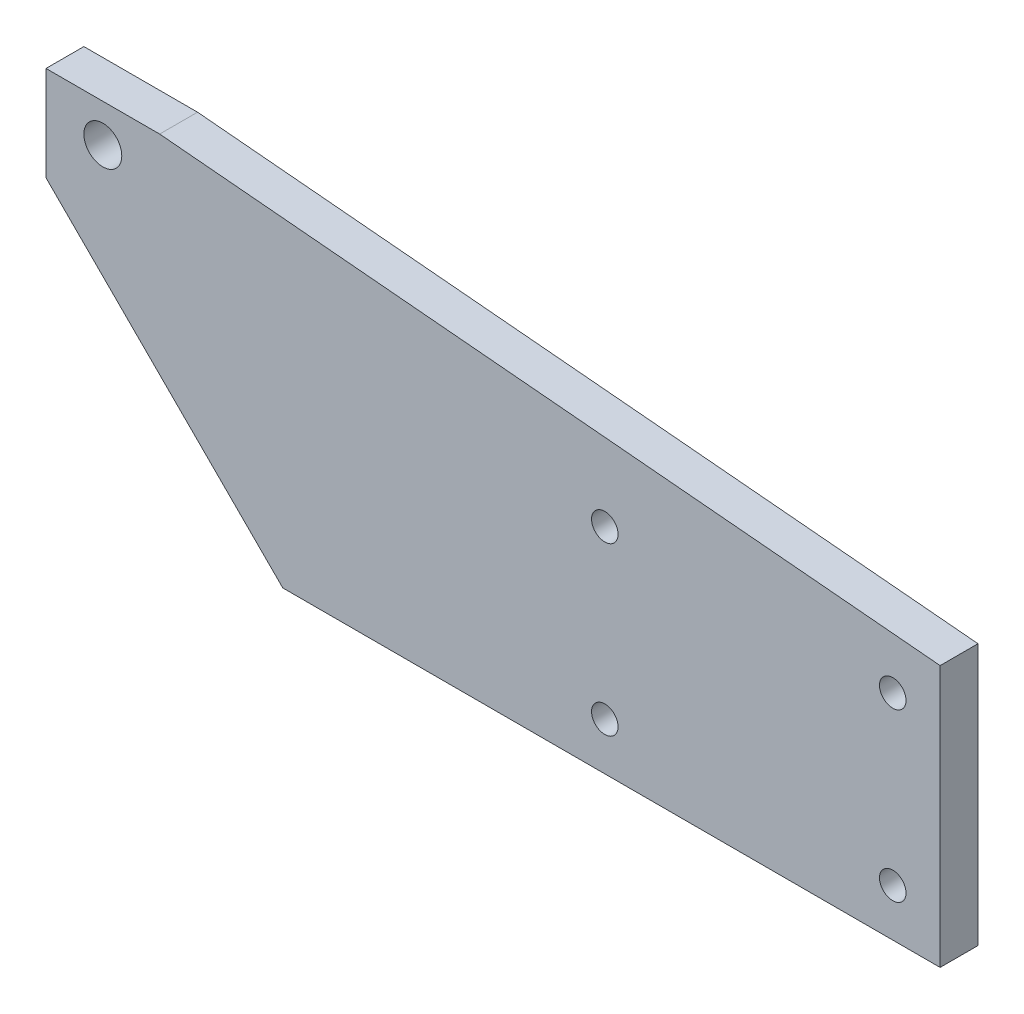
from build123d import *

# Parameters (mm, degrees)
ESQUISSE1_R          = 10
ESQUISSE1_R_2        = 7
BASE_EXTRUSION_DEPTH = 20


with BuildPart() as part:
    # Esquisse1 → Base-Extrusion (new body)
    with BuildSketch(Plane.XY):
        Polygon((0, 125), (0, 175), (60, 175), (472, 138), (472, 0), (125, 0), align=None)
        with Locations((30, 155)):
            Circle(ESQUISSE1_R, mode=Mode.SUBTRACT)
        with Locations((447, 25)):
            Circle(ESQUISSE1_R_2, mode=Mode.SUBTRACT)
        with Locations((447, 113)):
            Circle(ESQUISSE1_R_2, mode=Mode.SUBTRACT)
        with Locations((295, 25)):
            Circle(ESQUISSE1_R_2, mode=Mode.SUBTRACT)
        with Locations((295, 113)):
            Circle(ESQUISSE1_R_2, mode=Mode.SUBTRACT)
    extrude(amount=BASE_EXTRUSION_DEPTH)


solid = part.part
